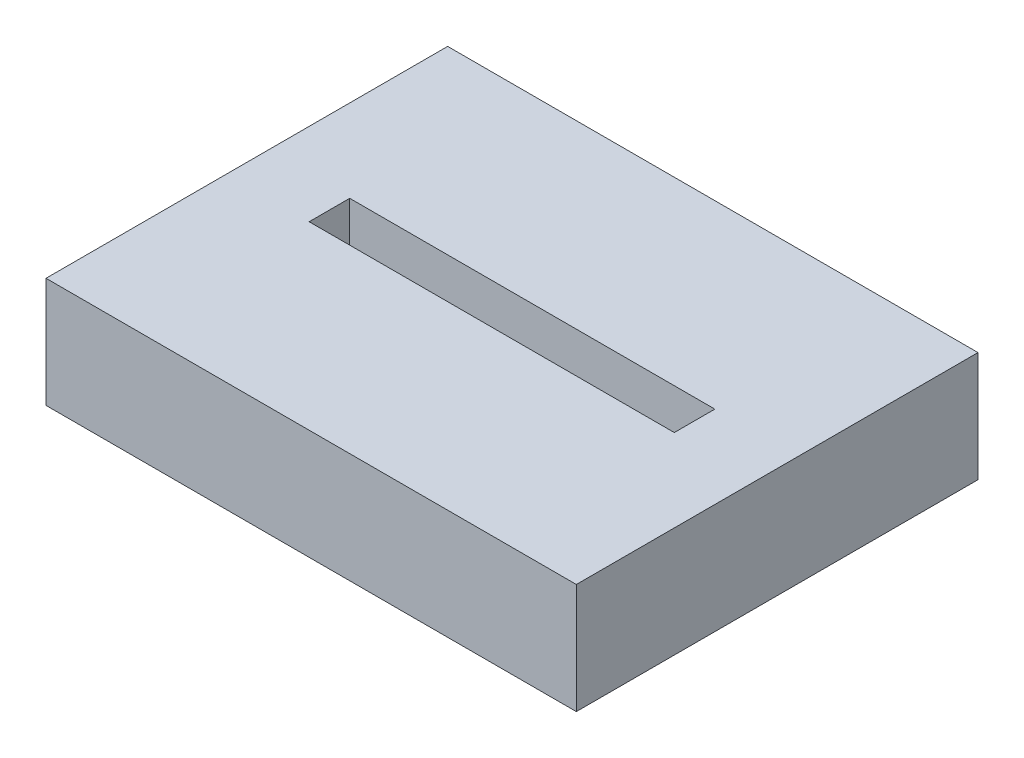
from build123d import *

# Parameters (mm, degrees)
ESQUISSE1_W             = 45.75
ESQUISSE1_H             = 34.65
BOSS_EXTRU_1_DEPTH      = 9.5
ESQUISSE2_W             = 31.5
ESQUISSE2_H             = 3.5
ENL_V_MAT_EXTRU_1_DEPTH = 5


with BuildPart() as part:
    # Esquisse1 → Boss.-Extru.1 (new body)
    with BuildSketch(Plane(origin=(0, 0, 0), x_dir=(1, 0, 0), z_dir=(0, 1, 0))):
        Rectangle(ESQUISSE1_W, ESQUISSE1_H)
    extrude(amount=BOSS_EXTRU_1_DEPTH)

    # Esquisse2 → Enl_v. mat.-Extru.1 (cut)
    with BuildSketch(Plane(origin=(0, 9.5, 0), x_dir=(1, 0, 0), z_dir=(0, 1, 0))):
        Rectangle(ESQUISSE2_W, ESQUISSE2_H)
    extrude(amount=-ENL_V_MAT_EXTRU_1_DEPTH, mode=Mode.SUBTRACT)


solid = part.part
